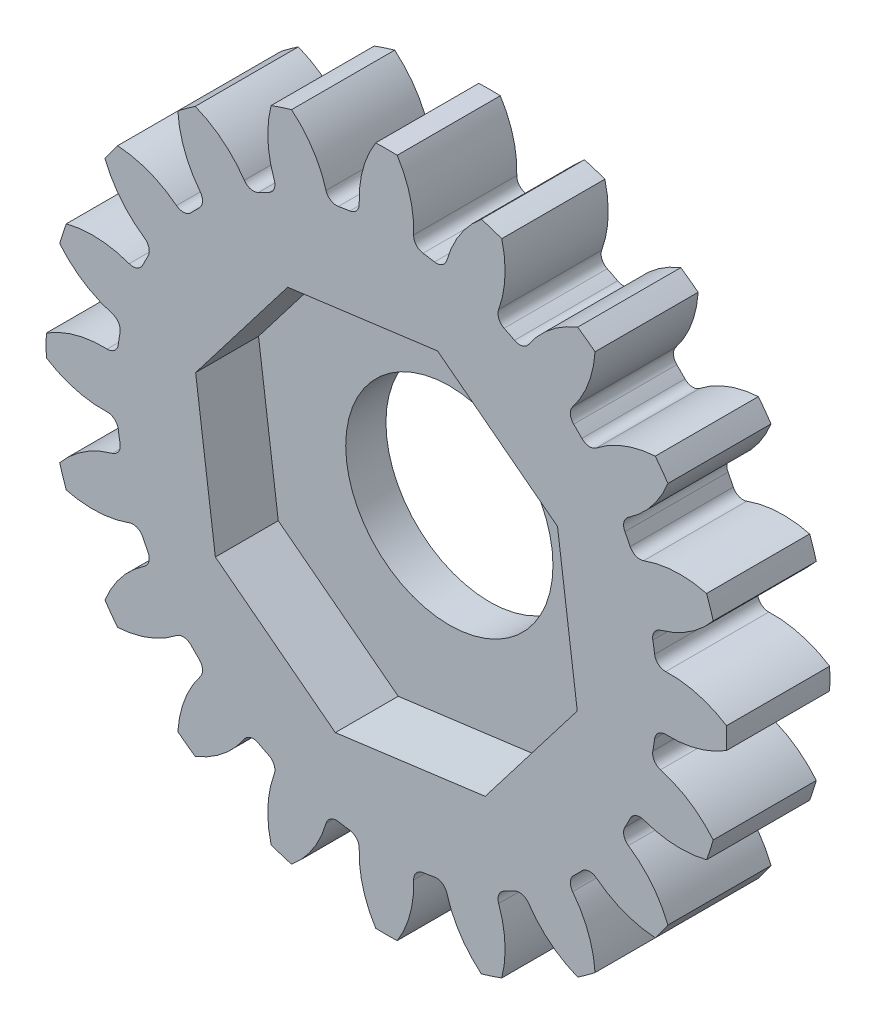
from build123d import *

# Parameters (mm, degrees)
BOSS_EXTRU_1_DEPTH                 = 10
CONG_1_R                           = 1.05
R_P_TITION_CIRCULAIRE4_COUNT       = 20
CONG_1_OF_R_P_TITION_CIRCULAIRE4_R = 1.05
ESQUISSE6_R                        = 10.05
ENL_V_MAT_EXTRU_2_DEPTH            = 10
ENL_V_MAT_EXTRU_3_DEPTH            = 6.1


with BuildPart() as part:
    # Esquisse3 → Boss.-Extru.1 (new body)
    with BuildSketch(Plane.XY):
        with BuildLine():
            Line((-5.48511162, 25.366466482), (-1.378706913, -0.560352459))
            Line((-1.378706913, -0.560352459), (2.727697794, 25.366466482))
            ThreePointArc((2.727697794, 25.366466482), (1.956271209, 25.476936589), (1.181905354, 25.564458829))
            ThreePointArc((1.181905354, 25.564458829), (1.026243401, 29.1274489), (-0.336560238, 32.423187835))
            ThreePointArc((-0.336560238, 32.423187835), (-1.378706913, 32.439647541), (-2.420853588, 32.423187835))
            ThreePointArc((-2.420853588, 32.423187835), (-3.783657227, 29.1274489), (-3.93931918, 25.564458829))
            ThreePointArc((-3.93931918, 25.564458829), (-4.713685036, 25.476936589), (-5.48511162, 25.366466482))
        make_face()
    boss_extru_1 = extrude(amount=BOSS_EXTRU_1_DEPTH)

    # Cong_1
    cong_1_edges = [part.edges().sort_by_distance(p)[0] for p in [
        (-3.93931918, 25.564458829, 5),
        (1.181905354, 25.564458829, 5),
    ]]
    fillet(cong_1_edges, radius=CONG_1_R)

    # R_p_tition circulaire4: Boss.-Extru.1 ×20 about axis
    r_p_tition_circulaire4_axis = Axis((-1.378706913, -0.560352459, 0), (0, 0, 1))
    for i in range(1, R_P_TITION_CIRCULAIRE4_COUNT):
        add(boss_extru_1.rotate(r_p_tition_circulaire4_axis, i * 360 / R_P_TITION_CIRCULAIRE4_COUNT))

    # Cong_1 of R_p_tition circulaire4
    cong_1_of_r_p_tition_circulaire4_edges = [part.edges().sort_by_distance(p)[0] for p in [
        (-11.887004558, 23.494546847, 5),
        (-7.016430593, 25.07709226, 5),
        (-18.806064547, 19.06997372, 5),
        (-14.662906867, 22.080153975, 5),
        (-24.019213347, 12.723847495, 5),
        (-21.009033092, 16.867005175, 5),
        (-27.016151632, 5.077371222, 5),
        (-25.433606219, 9.947945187, 5),
        (-27.503518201, -3.120964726, 5),
        (-27.503518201, 2.000259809, 5),
        (-25.433606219, -11.068650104, 5),
        (-27.016151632, -6.198076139, 5),
        (-21.009033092, -17.987710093, 5),
        (-24.019213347, -13.844552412, 5),
        (-14.662906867, -23.200858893, 5),
        (-18.806064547, -20.190678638, 5),
        (-7.016430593, -26.197797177, 5),
        (-11.887004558, -24.615251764, 5),
        (1.181905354, -26.685163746, 5),
        (-3.93931918, -26.685163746, 5),
        (9.129590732, -24.615251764, 5),
        (4.259016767, -26.197797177, 5),
        (16.048650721, -20.190678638, 5),
        (11.90549304, -23.200858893, 5),
        (21.261799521, -13.844552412, 5),
        (18.251619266, -17.987710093, 5),
        (24.258737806, -6.198076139, 5),
        (22.676192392, -11.068650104, 5),
        (24.746104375, 2.000259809, 5),
        (24.746104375, -3.120964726, 5),
        (22.676192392, 9.947945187, 5),
        (24.258737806, 5.077371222, 5),
        (18.251619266, 16.867005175, 5),
        (21.261799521, 12.723847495, 5),
        (11.90549304, 22.080153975, 5),
        (16.048650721, 19.06997372, 5),
        (4.259016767, 25.07709226, 5),
        (9.129590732, 23.494546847, 5),
    ]]
    fillet(cong_1_of_r_p_tition_circulaire4_edges, radius=CONG_1_OF_R_P_TITION_CIRCULAIRE4_R)

    # Esquisse6 → Enl_v. mat.-Extru.2 (cut)
    with BuildSketch(Plane.XY.offset(10)):
        with Locations((-1.378706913, -0.560352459)):
            Circle(ESQUISSE6_R)
    extrude(amount=-ENL_V_MAT_EXTRU_2_DEPTH, mode=Mode.SUBTRACT)

    # Esquisse8 → Enl_v. mat.-Extru.3 (cut)
    with BuildSketch(Plane.XY.offset(10)):
        Polygon((8.200464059, -17.151963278), (17.126830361, -5.518896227), (15.212903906, 9.018818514), (3.579836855, 17.945184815), (-10.957877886, 16.03125836), (-19.884244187, 4.398191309), (-17.970317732, -10.139523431), (-6.337250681, -19.065889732), align=None)
    extrude(amount=-ENL_V_MAT_EXTRU_3_DEPTH, mode=Mode.SUBTRACT)


solid = part.part
